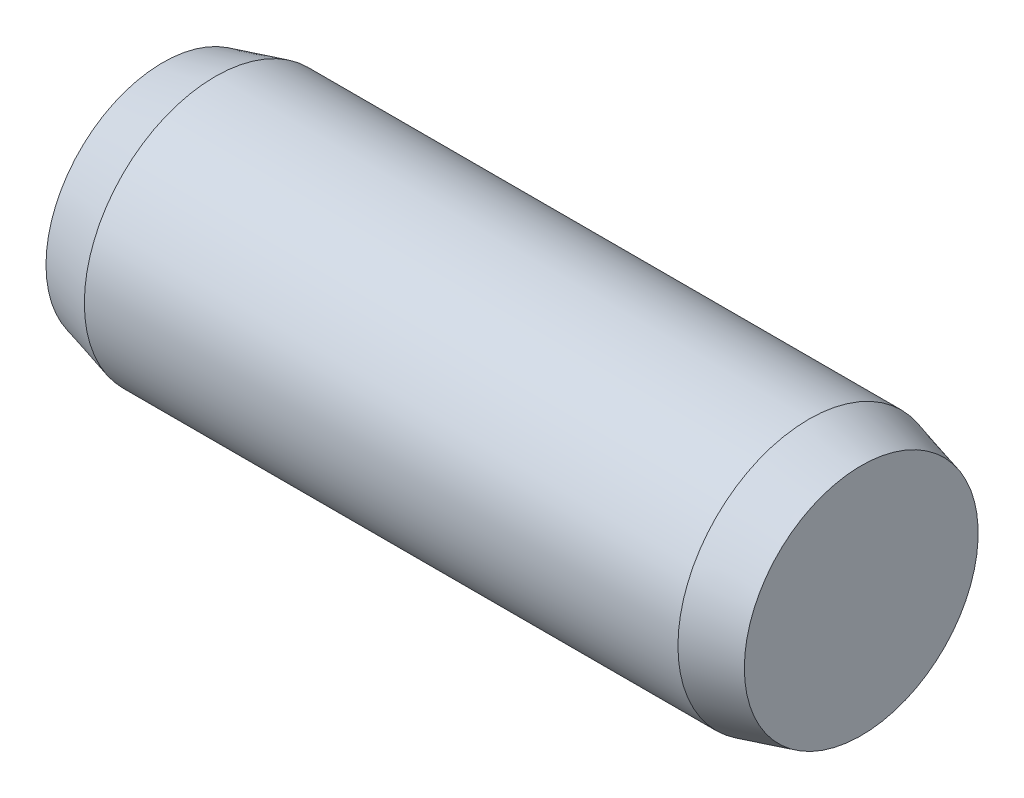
ISO-10303-21;
HEADER;
FILE_DESCRIPTION(('STEP AP214'),'2;1');
FILE_NAME('part.step','',(''),(''),'','','');
FILE_SCHEMA(('AUTOMOTIVE_DESIGN { 1 0 10303 214 1 1 1 1 }'));
ENDSEC;
DATA;
#1=APPLICATION_CONTEXT('core data for automotive mechanical design processes');
#2=APPLICATION_PROTOCOL_DEFINITION('international standard','automotive_design',2000,#1);
#3=PRODUCT_CONTEXT('',#1,'mechanical');
#4=PRODUCT('Part','Part','',(#3));
#5=PRODUCT_RELATED_PRODUCT_CATEGORY('part','',(#4));
#6=PRODUCT_DEFINITION_FORMATION('','',#4);
#7=PRODUCT_DEFINITION_CONTEXT('part definition',#1,'design');
#8=PRODUCT_DEFINITION('design','',#6,#7);
#9=PRODUCT_DEFINITION_SHAPE('','',#8);
#10=(LENGTH_UNIT() NAMED_UNIT(*) SI_UNIT(.MILLI.,.METRE.));
#11=(NAMED_UNIT(*) PLANE_ANGLE_UNIT() SI_UNIT($,.RADIAN.));
#12=(NAMED_UNIT(*) SI_UNIT($,.STERADIAN.) SOLID_ANGLE_UNIT());
#13=UNCERTAINTY_MEASURE_WITH_UNIT(LENGTH_MEASURE(1.E-05),#10,'distance_accuracy_value','');
#14=(GEOMETRIC_REPRESENTATION_CONTEXT(3) GLOBAL_UNCERTAINTY_ASSIGNED_CONTEXT((#13)) GLOBAL_UNIT_ASSIGNED_CONTEXT((#10,
#11,#12)) REPRESENTATION_CONTEXT('',''));
#15=CARTESIAN_POINT('',(0.,0.,0.));
#16=DIRECTION('',(0.,0.,1.));
#17=DIRECTION('',(1.,0.,0.));
#18=AXIS2_PLACEMENT_3D('',#15,#16,#17);
#19=CARTESIAN_POINT('',(0.,0.669615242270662,0.));
#20=DIRECTION('',(1.,0.,0.));
#21=DIRECTION('',(0.,0.,-1.));
#22=AXIS2_PLACEMENT_3D('',#19,#20,#21);
#23=PLANE('',#22);
#24=CARTESIAN_POINT('',(0.,0.,0.));
#25=DIRECTION('',(-1.,0.,0.));
#26=DIRECTION('',(0.,0.,1.));
#27=AXIS2_PLACEMENT_3D('',#24,#25,#26);
#28=CIRCLE('',#27,0.669615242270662);
#29=CARTESIAN_POINT('',(0.,0.,0.669615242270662));
#30=VERTEX_POINT('',#29);
#31=EDGE_CURVE('E10',#30,#30,#28,.T.);
#32=ORIENTED_EDGE('',*,*,#31,.T.);
#33=EDGE_LOOP('',(#32));
#34=FACE_BOUND('',#33,.T.);
#35=ADVANCED_FACE('F27',(#34),#23,.F.);
#36=CARTESIAN_POINT('',(0.3,0.,0.));
#37=DIRECTION('',(1.,0.,0.));
#38=DIRECTION('',(0.,0.,-1.));
#39=AXIS2_PLACEMENT_3D('',#36,#37,#38);
#40=CONICAL_SURFACE('',#39,0.749999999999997,0.261799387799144);
#41=ORIENTED_EDGE('',*,*,#31,.F.);
#42=EDGE_LOOP('',(#41));
#43=FACE_BOUND('',#42,.T.);
#44=CARTESIAN_POINT('',(0.3,0.,0.));
#45=DIRECTION('',(-1.,0.,0.));
#46=DIRECTION('',(0.,0.,1.));
#47=AXIS2_PLACEMENT_3D('',#44,#45,#46);
#48=CIRCLE('',#47,0.749999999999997);
#49=CARTESIAN_POINT('',(0.3,0.,0.749999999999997));
#50=VERTEX_POINT('',#49);
#51=EDGE_CURVE('E33',#50,#50,#48,.T.);
#52=ORIENTED_EDGE('',*,*,#51,.T.);
#53=EDGE_LOOP('',(#52));
#54=FACE_BOUND('',#53,.T.);
#55=ADVANCED_FACE('F59',(#43,#54),#40,.T.);
#56=CARTESIAN_POINT('',(-6.35,0.,0.));
#57=DIRECTION('',(-1.,0.,0.));
#58=DIRECTION('',(0.,0.,1.));
#59=AXIS2_PLACEMENT_3D('',#56,#57,#58);
#60=CYLINDRICAL_SURFACE('',#59,0.749999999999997);
#61=ORIENTED_EDGE('',*,*,#51,.F.);
#62=EDGE_LOOP('',(#61));
#63=FACE_BOUND('',#62,.T.);
#64=CARTESIAN_POINT('',(3.7,0.,0.));
#65=DIRECTION('',(-1.,0.,0.));
#66=DIRECTION('',(0.,0.,1.));
#67=AXIS2_PLACEMENT_3D('',#64,#65,#66);
#68=CIRCLE('',#67,0.749999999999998);
#69=CARTESIAN_POINT('',(3.7,0.,0.749999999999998));
#70=VERTEX_POINT('',#69);
#71=EDGE_CURVE('E37',#70,#70,#68,.T.);
#72=ORIENTED_EDGE('',*,*,#71,.T.);
#73=EDGE_LOOP('',(#72));
#74=FACE_BOUND('',#73,.T.);
#75=ADVANCED_FACE('F55',(#63,#74),#60,.T.);
#76=CARTESIAN_POINT('',(4.,0.,0.));
#77=DIRECTION('',(-1.,0.,0.));
#78=DIRECTION('',(0.,0.,1.));
#79=AXIS2_PLACEMENT_3D('',#76,#77,#78);
#80=CONICAL_SURFACE('',#79,0.669615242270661,0.26179938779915);
#81=ORIENTED_EDGE('',*,*,#71,.F.);
#82=EDGE_LOOP('',(#81));
#83=FACE_BOUND('',#82,.T.);
#84=CARTESIAN_POINT('',(4.,0.,0.));
#85=DIRECTION('',(-1.,0.,0.));
#86=DIRECTION('',(0.,0.,1.));
#87=AXIS2_PLACEMENT_3D('',#84,#85,#86);
#88=CIRCLE('',#87,0.669615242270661);
#89=CARTESIAN_POINT('',(4.,0.,0.669615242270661));
#90=VERTEX_POINT('',#89);
#91=EDGE_CURVE('E41',#90,#90,#88,.T.);
#92=ORIENTED_EDGE('',*,*,#91,.T.);
#93=EDGE_LOOP('',(#92));
#94=FACE_BOUND('',#93,.T.);
#95=ADVANCED_FACE('F47',(#83,#94),#80,.T.);
#96=CARTESIAN_POINT('',(4.,0.,0.));
#97=DIRECTION('',(-1.,0.,0.));
#98=DIRECTION('',(0.,0.,1.));
#99=AXIS2_PLACEMENT_3D('',#96,#97,#98);
#100=PLANE('',#99);
#101=ORIENTED_EDGE('',*,*,#91,.F.);
#102=EDGE_LOOP('',(#101));
#103=FACE_BOUND('',#102,.T.);
#104=ADVANCED_FACE('F49',(#103),#100,.F.);
#105=CLOSED_SHELL('',(#35,#55,#75,#95,#104));
#106=MANIFOLD_SOLID_BREP('B2',#105);
#107=ADVANCED_BREP_SHAPE_REPRESENTATION('',(#18,#106),#14);
#108=SHAPE_DEFINITION_REPRESENTATION(#9,#107);
ENDSEC;
END-ISO-10303-21;
